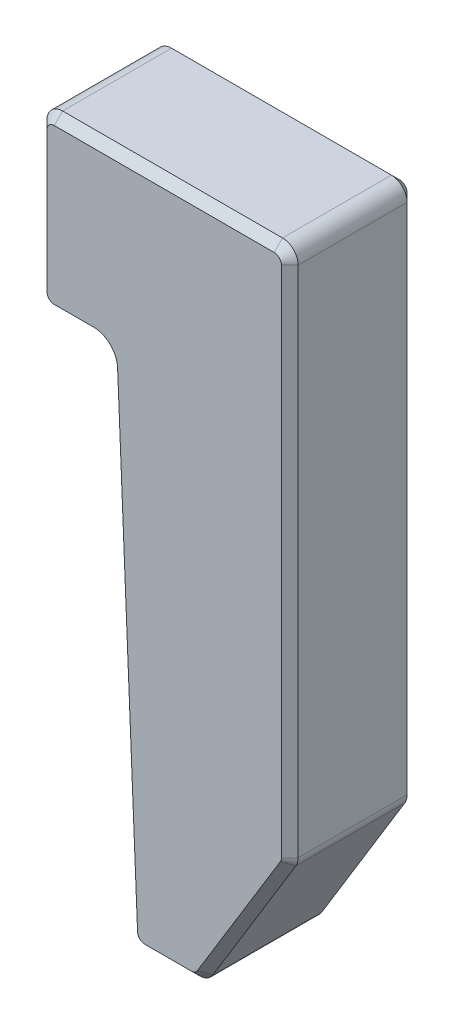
ISO-10303-21;
HEADER;
FILE_DESCRIPTION(('STEP AP214'),'2;1');
FILE_NAME('part.step','',(''),(''),'','','');
FILE_SCHEMA(('AUTOMOTIVE_DESIGN { 1 0 10303 214 1 1 1 1 }'));
ENDSEC;
DATA;
#1=APPLICATION_CONTEXT('core data for automotive mechanical design processes');
#2=APPLICATION_PROTOCOL_DEFINITION('international standard','automotive_design',2000,#1);
#3=PRODUCT_CONTEXT('',#1,'mechanical');
#4=PRODUCT('Part','Part','',(#3));
#5=PRODUCT_RELATED_PRODUCT_CATEGORY('part','',(#4));
#6=PRODUCT_DEFINITION_FORMATION('','',#4);
#7=PRODUCT_DEFINITION_CONTEXT('part definition',#1,'design');
#8=PRODUCT_DEFINITION('design','',#6,#7);
#9=PRODUCT_DEFINITION_SHAPE('','',#8);
#10=(LENGTH_UNIT() NAMED_UNIT(*) SI_UNIT(.MILLI.,.METRE.));
#11=(NAMED_UNIT(*) PLANE_ANGLE_UNIT() SI_UNIT($,.RADIAN.));
#12=(NAMED_UNIT(*) SI_UNIT($,.STERADIAN.) SOLID_ANGLE_UNIT());
#13=UNCERTAINTY_MEASURE_WITH_UNIT(LENGTH_MEASURE(1.E-05),#10,'distance_accuracy_value','');
#14=(GEOMETRIC_REPRESENTATION_CONTEXT(3) GLOBAL_UNCERTAINTY_ASSIGNED_CONTEXT((#13)) GLOBAL_UNIT_ASSIGNED_CONTEXT((#10,
#11,#12)) REPRESENTATION_CONTEXT('',''));
#15=CARTESIAN_POINT('',(0.,0.,0.));
#16=DIRECTION('',(0.,0.,1.));
#17=DIRECTION('',(1.,0.,0.));
#18=AXIS2_PLACEMENT_3D('',#15,#16,#17);
#19=CARTESIAN_POINT('',(3.445,3.61948185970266,3.));
#20=DIRECTION('',(0.,0.,-1.));
#21=DIRECTION('',(-1.,0.,0.));
#22=AXIS2_PLACEMENT_3D('',#19,#20,#21);
#23=CYLINDRICAL_SURFACE('',#22,0.375);
#24=DIRECTION('',(0.,0.,-1.));
#25=VECTOR('',#24,1.);
#26=CARTESIAN_POINT('',(3.76508154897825,3.42410324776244,3.));
#27=LINE('',#26,#25);
#28=CARTESIAN_POINT('',(3.76508154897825,3.42410324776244,2.8));
#29=VERTEX_POINT('',#28);
#30=CARTESIAN_POINT('',(3.76508154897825,3.42410324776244,0.200000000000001));
#31=VERTEX_POINT('',#30);
#32=EDGE_CURVE('E341',#29,#31,#27,.T.);
#33=ORIENTED_EDGE('',*,*,#32,.T.);
#34=CARTESIAN_POINT('',(3.445,3.61948185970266,0.200000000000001));
#35=DIRECTION('',(0.,0.,-1.));
#36=DIRECTION('',(-1.,0.,0.));
#37=AXIS2_PLACEMENT_3D('',#34,#35,#36);
#38=CIRCLE('',#37,0.375);
#39=CARTESIAN_POINT('',(3.82,3.61948185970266,0.200000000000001));
#40=VERTEX_POINT('',#39);
#41=EDGE_CURVE('E450',#31,#40,#38,.F.);
#42=ORIENTED_EDGE('',*,*,#41,.T.);
#43=DIRECTION('',(0.,0.,-1.));
#44=VECTOR('',#43,1.);
#45=CARTESIAN_POINT('',(3.82,3.61948185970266,3.));
#46=LINE('',#45,#44);
#47=CARTESIAN_POINT('',(3.82,3.61948185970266,2.8));
#48=VERTEX_POINT('',#47);
#49=EDGE_CURVE('E247',#48,#40,#46,.T.);
#50=ORIENTED_EDGE('',*,*,#49,.F.);
#51=CARTESIAN_POINT('',(3.445,3.61948185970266,2.8));
#52=DIRECTION('',(0.,0.,-1.));
#53=DIRECTION('',(-1.,0.,0.));
#54=AXIS2_PLACEMENT_3D('',#51,#52,#53);
#55=CIRCLE('',#54,0.375);
#56=EDGE_CURVE('E448',#48,#29,#55,.T.);
#57=ORIENTED_EDGE('',*,*,#56,.T.);
#58=EDGE_LOOP('',(#33,#42,#50,#57));
#59=FACE_BOUND('',#58,.T.);
#60=ADVANCED_FACE('F31',(#59),#23,.T.);
#61=CARTESIAN_POINT('',(3.82,15.875,3.));
#62=DIRECTION('',(-1.,0.,0.));
#63=DIRECTION('',(0.,-1.,0.));
#64=AXIS2_PLACEMENT_3D('',#61,#62,#63);
#65=PLANE('',#64);
#66=ORIENTED_EDGE('',*,*,#49,.T.);
#67=DIRECTION('',(0.,1.,0.));
#68=VECTOR('',#67,1.);
#69=CARTESIAN_POINT('',(3.82,15.875,0.200000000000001));
#70=LINE('',#69,#68);
#71=CARTESIAN_POINT('',(3.82,15.875,0.200000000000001));
#72=VERTEX_POINT('',#71);
#73=EDGE_CURVE('E458',#40,#72,#70,.T.);
#74=ORIENTED_EDGE('',*,*,#73,.T.);
#75=DIRECTION('',(0.,0.,-1.));
#76=VECTOR('',#75,1.);
#77=CARTESIAN_POINT('',(3.82,15.875,3.));
#78=LINE('',#77,#76);
#79=CARTESIAN_POINT('',(3.82,15.875,2.8));
#80=VERTEX_POINT('',#79);
#81=EDGE_CURVE('E377',#80,#72,#78,.T.);
#82=ORIENTED_EDGE('',*,*,#81,.F.);
#83=DIRECTION('',(0.,-1.,0.));
#84=VECTOR('',#83,1.);
#85=CARTESIAN_POINT('',(3.82,15.875,2.8));
#86=LINE('',#85,#84);
#87=EDGE_CURVE('E456',#80,#48,#86,.T.);
#88=ORIENTED_EDGE('',*,*,#87,.T.);
#89=EDGE_LOOP('',(#66,#74,#82,#88));
#90=FACE_BOUND('',#89,.T.);
#91=ADVANCED_FACE('F528',(#90),#65,.F.);
#92=CARTESIAN_POINT('',(3.445,15.875,3.));
#93=DIRECTION('',(0.,0.,-1.));
#94=DIRECTION('',(-1.,0.,0.));
#95=AXIS2_PLACEMENT_3D('',#92,#93,#94);
#96=CYLINDRICAL_SURFACE('',#95,0.375);
#97=ORIENTED_EDGE('',*,*,#81,.T.);
#98=CARTESIAN_POINT('',(3.445,15.875,0.200000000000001));
#99=DIRECTION('',(0.,0.,-1.));
#100=DIRECTION('',(-1.,0.,0.));
#101=AXIS2_PLACEMENT_3D('',#98,#99,#100);
#102=CIRCLE('',#101,0.375);
#103=CARTESIAN_POINT('',(3.44499999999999,16.25,0.200000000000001));
#104=VERTEX_POINT('',#103);
#105=EDGE_CURVE('E454',#72,#104,#102,.F.);
#106=ORIENTED_EDGE('',*,*,#105,.T.);
#107=DIRECTION('',(0.,0.,-1.));
#108=VECTOR('',#107,1.);
#109=CARTESIAN_POINT('',(3.44499999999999,16.25,3.));
#110=LINE('',#109,#108);
#111=CARTESIAN_POINT('',(3.44499999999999,16.25,2.8));
#112=VERTEX_POINT('',#111);
#113=EDGE_CURVE('E374',#112,#104,#110,.T.);
#114=ORIENTED_EDGE('',*,*,#113,.F.);
#115=CARTESIAN_POINT('',(3.445,15.875,2.8));
#116=DIRECTION('',(0.,0.,-1.));
#117=DIRECTION('',(-1.,0.,0.));
#118=AXIS2_PLACEMENT_3D('',#115,#116,#117);
#119=CIRCLE('',#118,0.375);
#120=EDGE_CURVE('E452',#112,#80,#119,.T.);
#121=ORIENTED_EDGE('',*,*,#120,.T.);
#122=EDGE_LOOP('',(#97,#106,#114,#121));
#123=FACE_BOUND('',#122,.T.);
#124=ADVANCED_FACE('F538',(#123),#96,.T.);
#125=CARTESIAN_POINT('',(-1.805,16.25,3.));
#126=DIRECTION('',(0.,-1.,0.));
#127=DIRECTION('',(0.,0.,-1.));
#128=AXIS2_PLACEMENT_3D('',#125,#126,#127);
#129=PLANE('',#128);
#130=ORIENTED_EDGE('',*,*,#113,.T.);
#131=DIRECTION('',(-1.,0.,0.));
#132=VECTOR('',#131,1.);
#133=CARTESIAN_POINT('',(-1.805,16.25,0.200000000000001));
#134=LINE('',#133,#132);
#135=CARTESIAN_POINT('',(-1.805,16.25,0.200000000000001));
#136=VERTEX_POINT('',#135);
#137=EDGE_CURVE('E446',#104,#136,#134,.T.);
#138=ORIENTED_EDGE('',*,*,#137,.T.);
#139=DIRECTION('',(0.,0.,-1.));
#140=VECTOR('',#139,1.);
#141=CARTESIAN_POINT('',(-1.805,16.25,3.));
#142=LINE('',#141,#140);
#143=CARTESIAN_POINT('',(-1.805,16.25,2.8));
#144=VERTEX_POINT('',#143);
#145=EDGE_CURVE('E371',#144,#136,#142,.T.);
#146=ORIENTED_EDGE('',*,*,#145,.F.);
#147=DIRECTION('',(1.,0.,0.));
#148=VECTOR('',#147,1.);
#149=CARTESIAN_POINT('',(-1.805,16.25,2.8));
#150=LINE('',#149,#148);
#151=EDGE_CURVE('E444',#144,#112,#150,.T.);
#152=ORIENTED_EDGE('',*,*,#151,.T.);
#153=EDGE_LOOP('',(#130,#138,#146,#152));
#154=FACE_BOUND('',#153,.T.);
#155=ADVANCED_FACE('F540',(#154),#129,.F.);
#156=CARTESIAN_POINT('',(-1.805,15.875,3.));
#157=DIRECTION('',(0.,0.,-1.));
#158=DIRECTION('',(-1.,0.,0.));
#159=AXIS2_PLACEMENT_3D('',#156,#157,#158);
#160=CYLINDRICAL_SURFACE('',#159,0.375);
#161=ORIENTED_EDGE('',*,*,#145,.T.);
#162=CARTESIAN_POINT('',(-1.805,15.875,0.200000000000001));
#163=DIRECTION('',(0.,0.,-1.));
#164=DIRECTION('',(-1.,0.,0.));
#165=AXIS2_PLACEMENT_3D('',#162,#163,#164);
#166=CIRCLE('',#165,0.375);
#167=CARTESIAN_POINT('',(-2.18,15.875,0.200000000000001));
#168=VERTEX_POINT('',#167);
#169=EDGE_CURVE('E438',#136,#168,#166,.F.);
#170=ORIENTED_EDGE('',*,*,#169,.T.);
#171=DIRECTION('',(0.,0.,-1.));
#172=VECTOR('',#171,1.);
#173=CARTESIAN_POINT('',(-2.18,15.875,3.));
#174=LINE('',#173,#172);
#175=CARTESIAN_POINT('',(-2.18,15.875,2.8));
#176=VERTEX_POINT('',#175);
#177=EDGE_CURVE('E368',#176,#168,#174,.T.);
#178=ORIENTED_EDGE('',*,*,#177,.F.);
#179=CARTESIAN_POINT('',(-1.805,15.875,2.8));
#180=DIRECTION('',(0.,0.,-1.));
#181=DIRECTION('',(-1.,0.,0.));
#182=AXIS2_PLACEMENT_3D('',#179,#180,#181);
#183=CIRCLE('',#182,0.375);
#184=EDGE_CURVE('E436',#176,#144,#183,.T.);
#185=ORIENTED_EDGE('',*,*,#184,.T.);
#186=EDGE_LOOP('',(#161,#170,#178,#185));
#187=FACE_BOUND('',#186,.T.);
#188=ADVANCED_FACE('F882',(#187),#160,.T.);
#189=CARTESIAN_POINT('',(-2.18,12.525,3.));
#190=DIRECTION('',(1.,0.,0.));
#191=DIRECTION('',(0.,0.,-1.));
#192=AXIS2_PLACEMENT_3D('',#189,#190,#191);
#193=PLANE('',#192);
#194=ORIENTED_EDGE('',*,*,#177,.T.);
#195=DIRECTION('',(0.,-1.,0.));
#196=VECTOR('',#195,1.);
#197=CARTESIAN_POINT('',(-2.18,12.525,0.200000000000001));
#198=LINE('',#197,#196);
#199=CARTESIAN_POINT('',(-2.18,12.525,0.200000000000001));
#200=VERTEX_POINT('',#199);
#201=EDGE_CURVE('E430',#168,#200,#198,.T.);
#202=ORIENTED_EDGE('',*,*,#201,.T.);
#203=DIRECTION('',(0.,0.,-1.));
#204=VECTOR('',#203,1.);
#205=CARTESIAN_POINT('',(-2.18,12.525,3.));
#206=LINE('',#205,#204);
#207=CARTESIAN_POINT('',(-2.18,12.525,2.8));
#208=VERTEX_POINT('',#207);
#209=EDGE_CURVE('E365',#208,#200,#206,.T.);
#210=ORIENTED_EDGE('',*,*,#209,.F.);
#211=DIRECTION('',(0.,1.,0.));
#212=VECTOR('',#211,1.);
#213=CARTESIAN_POINT('',(-2.18,12.525,2.8));
#214=LINE('',#213,#212);
#215=EDGE_CURVE('E428',#208,#176,#214,.T.);
#216=ORIENTED_EDGE('',*,*,#215,.T.);
#217=EDGE_LOOP('',(#194,#202,#210,#216));
#218=FACE_BOUND('',#217,.T.);
#219=ADVANCED_FACE('F873',(#218),#193,.F.);
#220=CARTESIAN_POINT('',(-1.805,12.525,3.));
#221=DIRECTION('',(0.,0.,-1.));
#222=DIRECTION('',(-1.,0.,0.));
#223=AXIS2_PLACEMENT_3D('',#220,#221,#222);
#224=CYLINDRICAL_SURFACE('',#223,0.375);
#225=ORIENTED_EDGE('',*,*,#209,.T.);
#226=CARTESIAN_POINT('',(-1.805,12.525,0.200000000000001));
#227=DIRECTION('',(0.,0.,-1.));
#228=DIRECTION('',(-1.,0.,0.));
#229=AXIS2_PLACEMENT_3D('',#226,#227,#228);
#230=CIRCLE('',#229,0.375);
#231=CARTESIAN_POINT('',(-1.805,12.15,0.200000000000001));
#232=VERTEX_POINT('',#231);
#233=EDGE_CURVE('E422',#200,#232,#230,.F.);
#234=ORIENTED_EDGE('',*,*,#233,.T.);
#235=DIRECTION('',(0.,0.,-1.));
#236=VECTOR('',#235,1.);
#237=CARTESIAN_POINT('',(-1.805,12.15,3.));
#238=LINE('',#237,#236);
#239=CARTESIAN_POINT('',(-1.805,12.15,2.8));
#240=VERTEX_POINT('',#239);
#241=EDGE_CURVE('E362',#240,#232,#238,.T.);
#242=ORIENTED_EDGE('',*,*,#241,.F.);
#243=CARTESIAN_POINT('',(-1.805,12.525,2.8));
#244=DIRECTION('',(0.,0.,-1.));
#245=DIRECTION('',(-1.,0.,0.));
#246=AXIS2_PLACEMENT_3D('',#243,#244,#245);
#247=CIRCLE('',#246,0.375);
#248=EDGE_CURVE('E420',#240,#208,#247,.T.);
#249=ORIENTED_EDGE('',*,*,#248,.T.);
#250=EDGE_LOOP('',(#225,#234,#242,#249));
#251=FACE_BOUND('',#250,.T.);
#252=ADVANCED_FACE('F864',(#251),#224,.T.);
#253=CARTESIAN_POINT('',(-0.866786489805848,12.15,3.));
#254=DIRECTION('',(0.,1.,0.));
#255=DIRECTION('',(0.,0.,1.));
#256=AXIS2_PLACEMENT_3D('',#253,#254,#255);
#257=PLANE('',#256);
#258=ORIENTED_EDGE('',*,*,#241,.T.);
#259=DIRECTION('',(1.,0.,0.));
#260=VECTOR('',#259,1.);
#261=CARTESIAN_POINT('',(-0.866786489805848,12.15,0.200000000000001));
#262=LINE('',#261,#260);
#263=CARTESIAN_POINT('',(-0.866786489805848,12.15,0.200000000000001));
#264=VERTEX_POINT('',#263);
#265=EDGE_CURVE('E414',#232,#264,#262,.T.);
#266=ORIENTED_EDGE('',*,*,#265,.T.);
#267=DIRECTION('',(0.,0.,-1.));
#268=VECTOR('',#267,1.);
#269=CARTESIAN_POINT('',(-0.866786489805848,12.15,3.));
#270=LINE('',#269,#268);
#271=CARTESIAN_POINT('',(-0.866786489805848,12.15,2.8));
#272=VERTEX_POINT('',#271);
#273=EDGE_CURVE('E242',#272,#264,#270,.T.);
#274=ORIENTED_EDGE('',*,*,#273,.F.);
#275=DIRECTION('',(-1.,0.,0.));
#276=VECTOR('',#275,1.);
#277=CARTESIAN_POINT('',(-0.866786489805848,12.15,2.8));
#278=LINE('',#277,#276);
#279=EDGE_CURVE('E412',#272,#240,#278,.T.);
#280=ORIENTED_EDGE('',*,*,#279,.T.);
#281=EDGE_LOOP('',(#258,#266,#274,#280));
#282=FACE_BOUND('',#281,.T.);
#283=ADVANCED_FACE('F856',(#282),#257,.F.);
#284=CARTESIAN_POINT('',(-0.866786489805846,11.775,3.));
#285=DIRECTION('',(0.,0.,-1.));
#286=DIRECTION('',(-1.,0.,0.));
#287=AXIS2_PLACEMENT_3D('',#284,#285,#286);
#288=CYLINDRICAL_SURFACE('',#287,0.375);
#289=ORIENTED_EDGE('',*,*,#273,.T.);
#290=CARTESIAN_POINT('',(-0.866786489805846,11.775,0.200000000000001));
#291=DIRECTION('',(0.,0.,-1.));
#292=DIRECTION('',(-1.,0.,0.));
#293=AXIS2_PLACEMENT_3D('',#290,#291,#292);
#294=CIRCLE('',#293,0.375);
#295=CARTESIAN_POINT('',(-0.492112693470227,11.7906379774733,0.200000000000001));
#296=VERTEX_POINT('',#295);
#297=EDGE_CURVE('E241',#264,#296,#294,.T.);
#298=ORIENTED_EDGE('',*,*,#297,.T.);
#299=DIRECTION('',(0.,0.,-1.));
#300=VECTOR('',#299,1.);
#301=CARTESIAN_POINT('',(-0.492112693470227,11.7906379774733,3.));
#302=LINE('',#301,#300);
#303=CARTESIAN_POINT('',(-0.492112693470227,11.7906379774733,2.8));
#304=VERTEX_POINT('',#303);
#305=EDGE_CURVE('E224',#304,#296,#302,.T.);
#306=ORIENTED_EDGE('',*,*,#305,.F.);
#307=CARTESIAN_POINT('',(-0.866786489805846,11.775,2.8));
#308=DIRECTION('',(0.,0.,-1.));
#309=DIRECTION('',(-1.,0.,0.));
#310=AXIS2_PLACEMENT_3D('',#307,#308,#309);
#311=CIRCLE('',#310,0.375);
#312=EDGE_CURVE('E238',#304,#272,#311,.F.);
#313=ORIENTED_EDGE('',*,*,#312,.T.);
#314=EDGE_LOOP('',(#289,#298,#306,#313));
#315=FACE_BOUND('',#314,.T.);
#316=ADVANCED_FACE('F237',(#315),#288,.F.);
#317=CARTESIAN_POINT('',(-0.0149989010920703,0.359362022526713,3.));
#318=DIRECTION('',(0.999130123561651,0.0417012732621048,0.));
#319=DIRECTION('',(-0.0417012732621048,0.999130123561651,0.));
#320=AXIS2_PLACEMENT_3D('',#317,#318,#319);
#321=PLANE('',#320);
#322=ORIENTED_EDGE('',*,*,#305,.T.);
#323=DIRECTION('',(0.0417012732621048,-0.999130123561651,0.));
#324=VECTOR('',#323,1.);
#325=CARTESIAN_POINT('',(-0.0149989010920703,0.359362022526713,0.200000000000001));
#326=LINE('',#325,#324);
#327=CARTESIAN_POINT('',(-0.0149989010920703,0.359362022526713,0.200000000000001));
#328=VERTEX_POINT('',#327);
#329=EDGE_CURVE('E230',#296,#328,#326,.T.);
#330=ORIENTED_EDGE('',*,*,#329,.T.);
#331=DIRECTION('',(0.,0.,-1.));
#332=VECTOR('',#331,1.);
#333=CARTESIAN_POINT('',(-0.0149989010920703,0.359362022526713,3.));
#334=LINE('',#333,#332);
#335=CARTESIAN_POINT('',(-0.0149989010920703,0.359362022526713,2.8));
#336=VERTEX_POINT('',#335);
#337=EDGE_CURVE('E226',#336,#328,#334,.T.);
#338=ORIENTED_EDGE('',*,*,#337,.F.);
#339=DIRECTION('',(-0.0417012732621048,0.999130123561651,0.));
#340=VECTOR('',#339,1.);
#341=CARTESIAN_POINT('',(-0.0149989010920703,0.359362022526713,2.8));
#342=LINE('',#341,#340);
#343=EDGE_CURVE('E221',#336,#304,#342,.T.);
#344=ORIENTED_EDGE('',*,*,#343,.T.);
#345=EDGE_LOOP('',(#322,#330,#338,#344));
#346=FACE_BOUND('',#345,.T.);
#347=ADVANCED_FACE('F223',(#346),#321,.F.);
#348=CARTESIAN_POINT('',(0.359674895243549,0.375,3.));
#349=DIRECTION('',(0.,0.,-1.));
#350=DIRECTION('',(-1.,0.,0.));
#351=AXIS2_PLACEMENT_3D('',#348,#349,#350);
#352=CYLINDRICAL_SURFACE('',#351,0.375);
#353=ORIENTED_EDGE('',*,*,#337,.T.);
#354=CARTESIAN_POINT('',(0.359674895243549,0.375,0.200000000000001));
#355=DIRECTION('',(0.,0.,-1.));
#356=DIRECTION('',(-1.,0.,0.));
#357=AXIS2_PLACEMENT_3D('',#354,#355,#356);
#358=CIRCLE('',#357,0.375);
#359=CARTESIAN_POINT('',(0.359674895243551,0.,0.200000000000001));
#360=VERTEX_POINT('',#359);
#361=EDGE_CURVE('E418',#328,#360,#358,.F.);
#362=ORIENTED_EDGE('',*,*,#361,.T.);
#363=DIRECTION('',(0.,0.,-1.));
#364=VECTOR('',#363,1.);
#365=CARTESIAN_POINT('',(0.359674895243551,0.,3.));
#366=LINE('',#365,#364);
#367=CARTESIAN_POINT('',(0.359674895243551,0.,2.8));
#368=VERTEX_POINT('',#367);
#369=EDGE_CURVE('E357',#368,#360,#366,.T.);
#370=ORIENTED_EDGE('',*,*,#369,.F.);
#371=CARTESIAN_POINT('',(0.359674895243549,0.375,2.8));
#372=DIRECTION('',(0.,0.,-1.));
#373=DIRECTION('',(-1.,0.,0.));
#374=AXIS2_PLACEMENT_3D('',#371,#372,#373);
#375=CIRCLE('',#374,0.375);
#376=EDGE_CURVE('E416',#368,#336,#375,.T.);
#377=ORIENTED_EDGE('',*,*,#376,.T.);
#378=EDGE_LOOP('',(#353,#362,#370,#377));
#379=FACE_BOUND('',#378,.T.);
#380=ADVANCED_FACE('F832',(#379),#352,.T.);
#381=CARTESIAN_POINT('',(1.46455981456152,0.,3.));
#382=DIRECTION('',(0.,1.,0.));
#383=DIRECTION('',(-1.,0.,0.));
#384=AXIS2_PLACEMENT_3D('',#381,#382,#383);
#385=PLANE('',#384);
#386=ORIENTED_EDGE('',*,*,#369,.T.);
#387=DIRECTION('',(1.,0.,0.));
#388=VECTOR('',#387,1.);
#389=CARTESIAN_POINT('',(1.46455981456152,0.,0.200000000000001));
#390=LINE('',#389,#388);
#391=CARTESIAN_POINT('',(1.46455981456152,0.,0.200000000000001));
#392=VERTEX_POINT('',#391);
#393=EDGE_CURVE('E426',#360,#392,#390,.T.);
#394=ORIENTED_EDGE('',*,*,#393,.T.);
#395=DIRECTION('',(0.,0.,-1.));
#396=VECTOR('',#395,1.);
#397=CARTESIAN_POINT('',(1.46455981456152,0.,3.));
#398=LINE('',#397,#396);
#399=CARTESIAN_POINT('',(1.46455981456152,0.,2.8));
#400=VERTEX_POINT('',#399);
#401=EDGE_CURVE('E352',#400,#392,#398,.T.);
#402=ORIENTED_EDGE('',*,*,#401,.F.);
#403=DIRECTION('',(-1.,0.,0.));
#404=VECTOR('',#403,1.);
#405=CARTESIAN_POINT('',(1.46455981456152,0.,2.8));
#406=LINE('',#405,#404);
#407=EDGE_CURVE('E424',#400,#368,#406,.T.);
#408=ORIENTED_EDGE('',*,*,#407,.T.);
#409=EDGE_LOOP('',(#386,#394,#402,#408));
#410=FACE_BOUND('',#409,.T.);
#411=ADVANCED_FACE('F823',(#410),#385,.F.);
#412=CARTESIAN_POINT('',(1.46455981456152,0.375,3.));
#413=DIRECTION('',(0.,0.,-1.));
#414=DIRECTION('',(-1.,0.,0.));
#415=AXIS2_PLACEMENT_3D('',#412,#413,#414);
#416=CYLINDRICAL_SURFACE('',#415,0.375);
#417=ORIENTED_EDGE('',*,*,#401,.T.);
#418=CARTESIAN_POINT('',(1.46455981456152,0.375,0.200000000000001));
#419=DIRECTION('',(0.,0.,-1.));
#420=DIRECTION('',(-1.,0.,0.));
#421=AXIS2_PLACEMENT_3D('',#418,#419,#420);
#422=CIRCLE('',#421,0.375);
#423=CARTESIAN_POINT('',(1.78464136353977,0.179621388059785,0.200000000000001));
#424=VERTEX_POINT('',#423);
#425=EDGE_CURVE('E434',#392,#424,#422,.F.);
#426=ORIENTED_EDGE('',*,*,#425,.T.);
#427=DIRECTION('',(0.,0.,-1.));
#428=VECTOR('',#427,1.);
#429=CARTESIAN_POINT('',(1.78464136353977,0.179621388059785,3.));
#430=LINE('',#429,#428);
#431=CARTESIAN_POINT('',(1.78464136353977,0.179621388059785,2.8));
#432=VERTEX_POINT('',#431);
#433=EDGE_CURVE('E347',#432,#424,#430,.T.);
#434=ORIENTED_EDGE('',*,*,#433,.F.);
#435=CARTESIAN_POINT('',(1.46455981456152,0.375,2.8));
#436=DIRECTION('',(0.,0.,-1.));
#437=DIRECTION('',(-1.,0.,0.));
#438=AXIS2_PLACEMENT_3D('',#435,#436,#437);
#439=CIRCLE('',#438,0.375);
#440=EDGE_CURVE('E432',#432,#400,#439,.T.);
#441=ORIENTED_EDGE('',*,*,#440,.T.);
#442=EDGE_LOOP('',(#417,#426,#434,#441));
#443=FACE_BOUND('',#442,.T.);
#444=ADVANCED_FACE('F815',(#443),#416,.T.);
#445=CARTESIAN_POINT('',(3.76508154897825,3.42410324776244,3.));
#446=DIRECTION('',(-0.853550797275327,0.521009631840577,0.));
#447=DIRECTION('',(-0.521009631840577,-0.853550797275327,0.));
#448=AXIS2_PLACEMENT_3D('',#445,#446,#447);
#449=PLANE('',#448);
#450=ORIENTED_EDGE('',*,*,#433,.T.);
#451=DIRECTION('',(0.521009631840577,0.853550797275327,0.));
#452=VECTOR('',#451,1.);
#453=CARTESIAN_POINT('',(3.76508154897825,3.42410324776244,0.200000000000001));
#454=LINE('',#453,#452);
#455=EDGE_CURVE('E442',#424,#31,#454,.T.);
#456=ORIENTED_EDGE('',*,*,#455,.T.);
#457=ORIENTED_EDGE('',*,*,#32,.F.);
#458=DIRECTION('',(-0.521009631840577,-0.853550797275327,0.));
#459=VECTOR('',#458,1.);
#460=CARTESIAN_POINT('',(3.76508154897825,3.42410324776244,2.8));
#461=LINE('',#460,#459);
#462=EDGE_CURVE('E440',#29,#432,#461,.T.);
#463=ORIENTED_EDGE('',*,*,#462,.T.);
#464=EDGE_LOOP('',(#450,#456,#457,#463));
#465=FACE_BOUND('',#464,.T.);
#466=ADVANCED_FACE('F507',(#465),#449,.F.);
#467=CARTESIAN_POINT('',(3.445,3.61948185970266,3.));
#468=DIRECTION('',(0.,0.,-1.));
#469=DIRECTION('',(-1.,0.,0.));
#470=AXIS2_PLACEMENT_3D('',#467,#468,#469);
#471=PLANE('',#470);
#472=DIRECTION('',(1.,0.,0.));
#473=VECTOR('',#472,1.);
#474=CARTESIAN_POINT('',(3.445,12.35,3.));
#475=LINE('',#474,#473);
#476=CARTESIAN_POINT('',(-1.805,12.35,3.));
#477=VERTEX_POINT('',#476);
#478=CARTESIAN_POINT('',(-0.86678648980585,12.35,3.));
#479=VERTEX_POINT('',#478);
#480=EDGE_CURVE('E55',#477,#479,#475,.T.);
#481=ORIENTED_EDGE('',*,*,#480,.T.);
#482=CARTESIAN_POINT('',(-0.866786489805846,11.775,3.));
#483=DIRECTION('',(0.,0.,-1.));
#484=DIRECTION('',(-1.,0.,0.));
#485=AXIS2_PLACEMENT_3D('',#482,#483,#484);
#486=CIRCLE('',#485,0.574999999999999);
#487=CARTESIAN_POINT('',(-0.292286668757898,11.7989782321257,3.));
#488=VERTEX_POINT('',#487);
#489=EDGE_CURVE('E11',#479,#488,#486,.T.);
#490=ORIENTED_EDGE('',*,*,#489,.T.);
#491=DIRECTION('',(0.0417012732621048,-0.999130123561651,0.));
#492=VECTOR('',#491,1.);
#493=CARTESIAN_POINT('',(0.0550111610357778,3.47799193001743,3.));
#494=LINE('',#493,#492);
#495=CARTESIAN_POINT('',(0.184827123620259,0.367702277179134,3.));
#496=VERTEX_POINT('',#495);
#497=EDGE_CURVE('E40',#488,#496,#494,.T.);
#498=ORIENTED_EDGE('',*,*,#497,.T.);
#499=CARTESIAN_POINT('',(0.359674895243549,0.375,3.));
#500=DIRECTION('',(0.,0.,-1.));
#501=DIRECTION('',(-1.,0.,0.));
#502=AXIS2_PLACEMENT_3D('',#499,#500,#501);
#503=CIRCLE('',#502,0.175000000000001);
#504=CARTESIAN_POINT('',(0.35967489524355,0.199999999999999,3.));
#505=VERTEX_POINT('',#504);
#506=EDGE_CURVE('E480',#496,#505,#503,.F.);
#507=ORIENTED_EDGE('',*,*,#506,.T.);
#508=DIRECTION('',(1.,0.,0.));
#509=VECTOR('',#508,1.);
#510=CARTESIAN_POINT('',(3.445,0.199999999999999,3.));
#511=LINE('',#510,#509);
#512=CARTESIAN_POINT('',(1.46455981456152,0.199999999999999,3.));
#513=VERTEX_POINT('',#512);
#514=EDGE_CURVE('E476',#505,#513,#511,.T.);
#515=ORIENTED_EDGE('',*,*,#514,.T.);
#516=CARTESIAN_POINT('',(1.46455981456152,0.375,3.));
#517=DIRECTION('',(0.,0.,-1.));
#518=DIRECTION('',(-1.,0.,0.));
#519=AXIS2_PLACEMENT_3D('',#516,#517,#518);
#520=CIRCLE('',#519,0.175000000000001);
#521=CARTESIAN_POINT('',(1.6139312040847,0.283823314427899,3.));
#522=VERTEX_POINT('',#521);
#523=EDGE_CURVE('E472',#513,#522,#520,.F.);
#524=ORIENTED_EDGE('',*,*,#523,.T.);
#525=DIRECTION('',(0.521009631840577,0.853550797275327,0.));
#526=VECTOR('',#525,1.);
#527=CARTESIAN_POINT('',(3.59437138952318,3.52830517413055,3.));
#528=LINE('',#527,#526);
#529=CARTESIAN_POINT('',(3.59437138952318,3.52830517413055,3.));
#530=VERTEX_POINT('',#529);
#531=EDGE_CURVE('E468',#522,#530,#528,.T.);
#532=ORIENTED_EDGE('',*,*,#531,.T.);
#533=CARTESIAN_POINT('',(3.445,3.61948185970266,3.));
#534=DIRECTION('',(0.,0.,-1.));
#535=DIRECTION('',(-1.,0.,0.));
#536=AXIS2_PLACEMENT_3D('',#533,#534,#535);
#537=CIRCLE('',#536,0.175000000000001);
#538=CARTESIAN_POINT('',(3.62,3.61948185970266,3.));
#539=VERTEX_POINT('',#538);
#540=EDGE_CURVE('E464',#530,#539,#537,.F.);
#541=ORIENTED_EDGE('',*,*,#540,.T.);
#542=DIRECTION('',(0.,1.,0.));
#543=VECTOR('',#542,1.);
#544=CARTESIAN_POINT('',(3.62,3.61948185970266,3.));
#545=LINE('',#544,#543);
#546=CARTESIAN_POINT('',(3.62,15.875,3.));
#547=VERTEX_POINT('',#546);
#548=EDGE_CURVE('E460',#539,#547,#545,.T.);
#549=ORIENTED_EDGE('',*,*,#548,.T.);
#550=CARTESIAN_POINT('',(3.445,15.875,3.));
#551=DIRECTION('',(0.,0.,-1.));
#552=DIRECTION('',(-1.,0.,0.));
#553=AXIS2_PLACEMENT_3D('',#550,#551,#552);
#554=CIRCLE('',#553,0.175000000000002);
#555=CARTESIAN_POINT('',(3.44499999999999,16.05,3.));
#556=VERTEX_POINT('',#555);
#557=EDGE_CURVE('E462',#547,#556,#554,.F.);
#558=ORIENTED_EDGE('',*,*,#557,.T.);
#559=DIRECTION('',(-1.,0.,0.));
#560=VECTOR('',#559,1.);
#561=CARTESIAN_POINT('',(3.445,16.05,3.));
#562=LINE('',#561,#560);
#563=CARTESIAN_POINT('',(-1.805,16.05,3.));
#564=VERTEX_POINT('',#563);
#565=EDGE_CURVE('E466',#556,#564,#562,.T.);
#566=ORIENTED_EDGE('',*,*,#565,.T.);
#567=CARTESIAN_POINT('',(-1.805,15.875,3.));
#568=DIRECTION('',(0.,0.,-1.));
#569=DIRECTION('',(-1.,0.,0.));
#570=AXIS2_PLACEMENT_3D('',#567,#568,#569);
#571=CIRCLE('',#570,0.175000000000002);
#572=CARTESIAN_POINT('',(-1.98,15.875,3.));
#573=VERTEX_POINT('',#572);
#574=EDGE_CURVE('E470',#564,#573,#571,.F.);
#575=ORIENTED_EDGE('',*,*,#574,.T.);
#576=DIRECTION('',(0.,-1.,0.));
#577=VECTOR('',#576,1.);
#578=CARTESIAN_POINT('',(-1.98,3.61948185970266,3.));
#579=LINE('',#578,#577);
#580=CARTESIAN_POINT('',(-1.98,12.525,3.));
#581=VERTEX_POINT('',#580);
#582=EDGE_CURVE('E474',#573,#581,#579,.T.);
#583=ORIENTED_EDGE('',*,*,#582,.T.);
#584=CARTESIAN_POINT('',(-1.805,12.525,3.));
#585=DIRECTION('',(0.,0.,-1.));
#586=DIRECTION('',(-1.,0.,0.));
#587=AXIS2_PLACEMENT_3D('',#584,#585,#586);
#588=CIRCLE('',#587,0.175000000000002);
#589=EDGE_CURVE('E478',#581,#477,#588,.F.);
#590=ORIENTED_EDGE('',*,*,#589,.T.);
#591=EDGE_LOOP('',(#481,#490,#498,#507,#515,#524,#532,#541,#549,#558,#566,#575,#583,#590));
#592=FACE_BOUND('',#591,.T.);
#593=ADVANCED_FACE('F483',(#592),#471,.F.);
#594=CARTESIAN_POINT('',(3.445,3.61948185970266,0.));
#595=DIRECTION('',(0.,0.,-1.));
#596=DIRECTION('',(-1.,0.,0.));
#597=AXIS2_PLACEMENT_3D('',#594,#595,#596);
#598=PLANE('',#597);
#599=DIRECTION('',(-0.0417012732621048,0.999130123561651,0.));
#600=VECTOR('',#599,1.);
#601=CARTESIAN_POINT('',(-0.292286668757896,11.7989782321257,0.));
#602=LINE('',#601,#600);
#603=CARTESIAN_POINT('',(0.18482712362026,0.367702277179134,0.));
#604=VERTEX_POINT('',#603);
#605=CARTESIAN_POINT('',(-0.292286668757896,11.7989782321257,0.));
#606=VERTEX_POINT('',#605);
#607=EDGE_CURVE('E407',#604,#606,#602,.T.);
#608=ORIENTED_EDGE('',*,*,#607,.T.);
#609=CARTESIAN_POINT('',(-0.866786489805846,11.775,0.));
#610=DIRECTION('',(0.,0.,-1.));
#611=DIRECTION('',(-1.,0.,0.));
#612=AXIS2_PLACEMENT_3D('',#609,#610,#611);
#613=CIRCLE('',#612,0.575000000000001);
#614=CARTESIAN_POINT('',(-0.86678648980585,12.35,0.));
#615=VERTEX_POINT('',#614);
#616=EDGE_CURVE('E231',#606,#615,#613,.F.);
#617=ORIENTED_EDGE('',*,*,#616,.T.);
#618=DIRECTION('',(-1.,0.,0.));
#619=VECTOR('',#618,1.);
#620=CARTESIAN_POINT('',(-1.805,12.35,0.));
#621=LINE('',#620,#619);
#622=CARTESIAN_POINT('',(-1.805,12.35,0.));
#623=VERTEX_POINT('',#622);
#624=EDGE_CURVE('E405',#615,#623,#621,.T.);
#625=ORIENTED_EDGE('',*,*,#624,.T.);
#626=CARTESIAN_POINT('',(-1.805,12.525,0.));
#627=DIRECTION('',(0.,0.,-1.));
#628=DIRECTION('',(-1.,0.,0.));
#629=AXIS2_PLACEMENT_3D('',#626,#627,#628);
#630=CIRCLE('',#629,0.175);
#631=CARTESIAN_POINT('',(-1.98,12.525,0.));
#632=VERTEX_POINT('',#631);
#633=EDGE_CURVE('E401',#623,#632,#630,.T.);
#634=ORIENTED_EDGE('',*,*,#633,.T.);
#635=DIRECTION('',(0.,1.,0.));
#636=VECTOR('',#635,1.);
#637=CARTESIAN_POINT('',(-1.98,15.875,0.));
#638=LINE('',#637,#636);
#639=CARTESIAN_POINT('',(-1.98,15.875,0.));
#640=VERTEX_POINT('',#639);
#641=EDGE_CURVE('E397',#632,#640,#638,.T.);
#642=ORIENTED_EDGE('',*,*,#641,.T.);
#643=CARTESIAN_POINT('',(-1.805,15.875,0.));
#644=DIRECTION('',(0.,0.,-1.));
#645=DIRECTION('',(-1.,0.,0.));
#646=AXIS2_PLACEMENT_3D('',#643,#644,#645);
#647=CIRCLE('',#646,0.174999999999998);
#648=CARTESIAN_POINT('',(-1.805,16.05,0.));
#649=VERTEX_POINT('',#648);
#650=EDGE_CURVE('E393',#640,#649,#647,.T.);
#651=ORIENTED_EDGE('',*,*,#650,.T.);
#652=DIRECTION('',(1.,0.,0.));
#653=VECTOR('',#652,1.);
#654=CARTESIAN_POINT('',(3.44499999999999,16.05,0.));
#655=LINE('',#654,#653);
#656=CARTESIAN_POINT('',(3.44499999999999,16.05,0.));
#657=VERTEX_POINT('',#656);
#658=EDGE_CURVE('E389',#649,#657,#655,.T.);
#659=ORIENTED_EDGE('',*,*,#658,.T.);
#660=CARTESIAN_POINT('',(3.445,15.875,0.));
#661=DIRECTION('',(0.,0.,-1.));
#662=DIRECTION('',(-1.,0.,0.));
#663=AXIS2_PLACEMENT_3D('',#660,#661,#662);
#664=CIRCLE('',#663,0.174999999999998);
#665=CARTESIAN_POINT('',(3.62,15.875,0.));
#666=VERTEX_POINT('',#665);
#667=EDGE_CURVE('E385',#657,#666,#664,.T.);
#668=ORIENTED_EDGE('',*,*,#667,.T.);
#669=DIRECTION('',(0.,-1.,0.));
#670=VECTOR('',#669,1.);
#671=CARTESIAN_POINT('',(3.62,3.61948185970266,0.));
#672=LINE('',#671,#670);
#673=CARTESIAN_POINT('',(3.62,3.61948185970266,0.));
#674=VERTEX_POINT('',#673);
#675=EDGE_CURVE('E383',#666,#674,#672,.T.);
#676=ORIENTED_EDGE('',*,*,#675,.T.);
#677=CARTESIAN_POINT('',(3.445,3.61948185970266,0.));
#678=DIRECTION('',(0.,0.,-1.));
#679=DIRECTION('',(-1.,0.,0.));
#680=AXIS2_PLACEMENT_3D('',#677,#678,#679);
#681=CIRCLE('',#680,0.174999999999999);
#682=CARTESIAN_POINT('',(3.59437138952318,3.52830517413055,0.));
#683=VERTEX_POINT('',#682);
#684=EDGE_CURVE('E387',#674,#683,#681,.T.);
#685=ORIENTED_EDGE('',*,*,#684,.T.);
#686=DIRECTION('',(-0.521009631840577,-0.853550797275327,0.));
#687=VECTOR('',#686,1.);
#688=CARTESIAN_POINT('',(1.6139312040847,0.283823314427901,0.));
#689=LINE('',#688,#687);
#690=CARTESIAN_POINT('',(1.6139312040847,0.2838233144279,0.));
#691=VERTEX_POINT('',#690);
#692=EDGE_CURVE('E391',#683,#691,#689,.T.);
#693=ORIENTED_EDGE('',*,*,#692,.T.);
#694=CARTESIAN_POINT('',(1.46455981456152,0.375,0.));
#695=DIRECTION('',(0.,0.,-1.));
#696=DIRECTION('',(-1.,0.,0.));
#697=AXIS2_PLACEMENT_3D('',#694,#695,#696);
#698=CIRCLE('',#697,0.175);
#699=CARTESIAN_POINT('',(1.46455981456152,0.200000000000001,0.));
#700=VERTEX_POINT('',#699);
#701=EDGE_CURVE('E395',#691,#700,#698,.T.);
#702=ORIENTED_EDGE('',*,*,#701,.T.);
#703=DIRECTION('',(-1.,0.,0.));
#704=VECTOR('',#703,1.);
#705=CARTESIAN_POINT('',(0.359674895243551,0.200000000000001,0.));
#706=LINE('',#705,#704);
#707=CARTESIAN_POINT('',(0.35967489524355,0.200000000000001,0.));
#708=VERTEX_POINT('',#707);
#709=EDGE_CURVE('E399',#700,#708,#706,.T.);
#710=ORIENTED_EDGE('',*,*,#709,.T.);
#711=CARTESIAN_POINT('',(0.359674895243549,0.375,0.));
#712=DIRECTION('',(0.,0.,-1.));
#713=DIRECTION('',(-1.,0.,0.));
#714=AXIS2_PLACEMENT_3D('',#711,#712,#713);
#715=CIRCLE('',#714,0.175);
#716=EDGE_CURVE('E403',#708,#604,#715,.T.);
#717=ORIENTED_EDGE('',*,*,#716,.T.);
#718=EDGE_LOOP('',(#608,#617,#625,#634,#642,#651,#659,#668,#676,#685,#693,#702,#710,#717));
#719=FACE_BOUND('',#718,.T.);
#720=ADVANCED_FACE('F522',(#719),#598,.T.);
#721=CARTESIAN_POINT('',(3.82,15.875,0.200000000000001));
#722=DIRECTION('',(0.707106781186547,0.,-0.707106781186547));
#723=DIRECTION('',(-0.707106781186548,0.,-0.707106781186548));
#724=AXIS2_PLACEMENT_3D('',#721,#722,#723);
#725=PLANE('',#724);
#726=DIRECTION('',(0.707106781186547,0.,0.707106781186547));
#727=VECTOR('',#726,1.);
#728=CARTESIAN_POINT('',(3.62,3.61948185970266,0.));
#729=LINE('',#728,#727);
#730=EDGE_CURVE('E334',#674,#40,#729,.T.);
#731=ORIENTED_EDGE('',*,*,#730,.F.);
#732=ORIENTED_EDGE('',*,*,#675,.F.);
#733=DIRECTION('',(-0.707106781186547,0.,-0.707106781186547));
#734=VECTOR('',#733,1.);
#735=CARTESIAN_POINT('',(3.82,15.875,0.200000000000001));
#736=LINE('',#735,#734);
#737=EDGE_CURVE('E254',#72,#666,#736,.T.);
#738=ORIENTED_EDGE('',*,*,#737,.F.);
#739=ORIENTED_EDGE('',*,*,#73,.F.);
#740=EDGE_LOOP('',(#731,#732,#738,#739));
#741=FACE_BOUND('',#740,.T.);
#742=ADVANCED_FACE('F532',(#741),#725,.T.);
#743=CARTESIAN_POINT('',(3.445,15.875,0.200000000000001));
#744=DIRECTION('',(0.,0.,1.));
#745=DIRECTION('',(1.,0.,0.));
#746=AXIS2_PLACEMENT_3D('',#743,#744,#745);
#747=CONICAL_SURFACE('',#746,0.375,0.785398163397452);
#748=ORIENTED_EDGE('',*,*,#737,.T.);
#749=ORIENTED_EDGE('',*,*,#667,.F.);
#750=DIRECTION('',(0.,-0.707106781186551,-0.707106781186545));
#751=VECTOR('',#750,1.);
#752=CARTESIAN_POINT('',(3.44499999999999,16.25,0.200000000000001));
#753=LINE('',#752,#751);
#754=EDGE_CURVE('E332',#104,#657,#753,.T.);
#755=ORIENTED_EDGE('',*,*,#754,.F.);
#756=ORIENTED_EDGE('',*,*,#105,.F.);
#757=EDGE_LOOP('',(#748,#749,#755,#756));
#758=FACE_BOUND('',#757,.T.);
#759=ADVANCED_FACE('F534',(#758),#747,.T.);
#760=CARTESIAN_POINT('',(3.445,3.61948185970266,0.200000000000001));
#761=DIRECTION('',(0.,0.,1.));
#762=DIRECTION('',(1.,0.,0.));
#763=AXIS2_PLACEMENT_3D('',#760,#761,#762);
#764=CONICAL_SURFACE('',#763,0.375,0.785398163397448);
#765=ORIENTED_EDGE('',*,*,#730,.T.);
#766=ORIENTED_EDGE('',*,*,#41,.F.);
#767=DIRECTION('',(0.603551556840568,-0.368409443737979,0.707106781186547));
#768=VECTOR('',#767,1.);
#769=CARTESIAN_POINT('',(3.59437138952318,3.52830517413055,0.));
#770=LINE('',#769,#768);
#771=EDGE_CURVE('E329',#683,#31,#770,.T.);
#772=ORIENTED_EDGE('',*,*,#771,.F.);
#773=ORIENTED_EDGE('',*,*,#684,.F.);
#774=EDGE_LOOP('',(#765,#766,#772,#773));
#775=FACE_BOUND('',#774,.T.);
#776=ADVANCED_FACE('F525',(#775),#764,.T.);
#777=CARTESIAN_POINT('',(-1.805,16.25,0.200000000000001));
#778=DIRECTION('',(0.,0.707106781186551,-0.707106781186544));
#779=DIRECTION('',(0.,0.707106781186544,0.707106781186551));
#780=AXIS2_PLACEMENT_3D('',#777,#778,#779);
#781=PLANE('',#780);
#782=ORIENTED_EDGE('',*,*,#754,.T.);
#783=ORIENTED_EDGE('',*,*,#658,.F.);
#784=DIRECTION('',(0.,-0.707106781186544,-0.707106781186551));
#785=VECTOR('',#784,1.);
#786=CARTESIAN_POINT('',(-1.805,16.25,0.200000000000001));
#787=LINE('',#786,#785);
#788=EDGE_CURVE('E326',#136,#649,#787,.T.);
#789=ORIENTED_EDGE('',*,*,#788,.F.);
#790=ORIENTED_EDGE('',*,*,#137,.F.);
#791=EDGE_LOOP('',(#782,#783,#789,#790));
#792=FACE_BOUND('',#791,.T.);
#793=ADVANCED_FACE('F604',(#792),#781,.T.);
#794=CARTESIAN_POINT('',(3.76508154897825,3.42410324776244,0.200000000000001));
#795=DIRECTION('',(0.603551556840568,-0.368409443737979,-0.707106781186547));
#796=DIRECTION('',(-0.760604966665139,0.,-0.649214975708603));
#797=AXIS2_PLACEMENT_3D('',#794,#795,#796);
#798=PLANE('',#797);
#799=ORIENTED_EDGE('',*,*,#771,.T.);
#800=ORIENTED_EDGE('',*,*,#455,.F.);
#801=DIRECTION('',(0.60355155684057,-0.368409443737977,0.707106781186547));
#802=VECTOR('',#801,1.);
#803=CARTESIAN_POINT('',(1.6139312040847,0.2838233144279,0.));
#804=LINE('',#803,#802);
#805=EDGE_CURVE('E323',#691,#424,#804,.T.);
#806=ORIENTED_EDGE('',*,*,#805,.F.);
#807=ORIENTED_EDGE('',*,*,#692,.F.);
#808=EDGE_LOOP('',(#799,#800,#806,#807));
#809=FACE_BOUND('',#808,.T.);
#810=ADVANCED_FACE('F512',(#809),#798,.T.);
#811=CARTESIAN_POINT('',(-1.805,15.875,0.200000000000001));
#812=DIRECTION('',(0.,0.,1.));
#813=DIRECTION('',(1.,0.,0.));
#814=AXIS2_PLACEMENT_3D('',#811,#812,#813);
#815=CONICAL_SURFACE('',#814,0.375,0.785398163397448);
#816=ORIENTED_EDGE('',*,*,#788,.T.);
#817=ORIENTED_EDGE('',*,*,#650,.F.);
#818=DIRECTION('',(0.70710678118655,0.,-0.707106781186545));
#819=VECTOR('',#818,1.);
#820=CARTESIAN_POINT('',(-2.18,15.875,0.200000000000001));
#821=LINE('',#820,#819);
#822=EDGE_CURVE('E320',#168,#640,#821,.T.);
#823=ORIENTED_EDGE('',*,*,#822,.F.);
#824=ORIENTED_EDGE('',*,*,#169,.F.);
#825=EDGE_LOOP('',(#816,#817,#823,#824));
#826=FACE_BOUND('',#825,.T.);
#827=ADVANCED_FACE('F598',(#826),#815,.T.);
#828=CARTESIAN_POINT('',(1.46455981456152,0.375,0.200000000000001));
#829=DIRECTION('',(0.,0.,1.));
#830=DIRECTION('',(1.,0.,0.));
#831=AXIS2_PLACEMENT_3D('',#828,#829,#830);
#832=CONICAL_SURFACE('',#831,0.375,0.785398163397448);
#833=ORIENTED_EDGE('',*,*,#805,.T.);
#834=ORIENTED_EDGE('',*,*,#425,.F.);
#835=DIRECTION('',(0.,-0.707106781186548,0.707106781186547));
#836=VECTOR('',#835,1.);
#837=CARTESIAN_POINT('',(1.46455981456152,0.200000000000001,0.));
#838=LINE('',#837,#836);
#839=EDGE_CURVE('E317',#700,#392,#838,.T.);
#840=ORIENTED_EDGE('',*,*,#839,.F.);
#841=ORIENTED_EDGE('',*,*,#701,.F.);
#842=EDGE_LOOP('',(#833,#834,#840,#841));
#843=FACE_BOUND('',#842,.T.);
#844=ADVANCED_FACE('F518',(#843),#832,.T.);
#845=CARTESIAN_POINT('',(-2.18,12.525,0.200000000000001));
#846=DIRECTION('',(-0.707106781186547,0.,-0.707106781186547));
#847=DIRECTION('',(-0.707106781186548,0.,0.707106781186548));
#848=AXIS2_PLACEMENT_3D('',#845,#846,#847);
#849=PLANE('',#848);
#850=ORIENTED_EDGE('',*,*,#822,.T.);
#851=ORIENTED_EDGE('',*,*,#641,.F.);
#852=DIRECTION('',(0.707106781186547,0.,-0.707106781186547));
#853=VECTOR('',#852,1.);
#854=CARTESIAN_POINT('',(-2.18,12.525,0.200000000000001));
#855=LINE('',#854,#853);
#856=EDGE_CURVE('E314',#200,#632,#855,.T.);
#857=ORIENTED_EDGE('',*,*,#856,.F.);
#858=ORIENTED_EDGE('',*,*,#201,.F.);
#859=EDGE_LOOP('',(#850,#851,#857,#858));
#860=FACE_BOUND('',#859,.T.);
#861=ADVANCED_FACE('F591',(#860),#849,.T.);
#862=CARTESIAN_POINT('',(1.46455981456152,0.,0.200000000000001));
#863=DIRECTION('',(0.,-0.707106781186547,-0.707106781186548));
#864=DIRECTION('',(0.,0.707106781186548,-0.707106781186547));
#865=AXIS2_PLACEMENT_3D('',#862,#863,#864);
#866=PLANE('',#865);
#867=ORIENTED_EDGE('',*,*,#839,.T.);
#868=ORIENTED_EDGE('',*,*,#393,.F.);
#869=DIRECTION('',(0.,-0.707106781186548,0.707106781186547));
#870=VECTOR('',#869,1.);
#871=CARTESIAN_POINT('',(0.35967489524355,0.200000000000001,0.));
#872=LINE('',#871,#870);
#873=EDGE_CURVE('E311',#708,#360,#872,.T.);
#874=ORIENTED_EDGE('',*,*,#873,.F.);
#875=ORIENTED_EDGE('',*,*,#709,.F.);
#876=EDGE_LOOP('',(#867,#868,#874,#875));
#877=FACE_BOUND('',#876,.T.);
#878=ADVANCED_FACE('F587',(#877),#866,.T.);
#879=CARTESIAN_POINT('',(-1.805,12.525,0.200000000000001));
#880=DIRECTION('',(0.,0.,1.));
#881=DIRECTION('',(1.,0.,0.));
#882=AXIS2_PLACEMENT_3D('',#879,#880,#881);
#883=CONICAL_SURFACE('',#882,0.375,0.785398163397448);
#884=ORIENTED_EDGE('',*,*,#856,.T.);
#885=ORIENTED_EDGE('',*,*,#633,.F.);
#886=DIRECTION('',(0.,0.707106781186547,-0.707106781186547));
#887=VECTOR('',#886,1.);
#888=CARTESIAN_POINT('',(-1.805,12.15,0.200000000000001));
#889=LINE('',#888,#887);
#890=EDGE_CURVE('E308',#232,#623,#889,.T.);
#891=ORIENTED_EDGE('',*,*,#890,.F.);
#892=ORIENTED_EDGE('',*,*,#233,.F.);
#893=EDGE_LOOP('',(#884,#885,#891,#892));
#894=FACE_BOUND('',#893,.T.);
#895=ADVANCED_FACE('F583',(#894),#883,.T.);
#896=CARTESIAN_POINT('',(0.359674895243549,0.375,0.200000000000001));
#897=DIRECTION('',(0.,0.,1.));
#898=DIRECTION('',(1.,0.,0.));
#899=AXIS2_PLACEMENT_3D('',#896,#897,#898);
#900=CONICAL_SURFACE('',#899,0.375,0.785398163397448);
#901=ORIENTED_EDGE('',*,*,#873,.T.);
#902=ORIENTED_EDGE('',*,*,#361,.F.);
#903=DIRECTION('',(-0.706491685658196,-0.0294872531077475,0.707106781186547));
#904=VECTOR('',#903,1.);
#905=CARTESIAN_POINT('',(0.18482712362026,0.367702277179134,0.));
#906=LINE('',#905,#904);
#907=EDGE_CURVE('E302',#604,#328,#906,.T.);
#908=ORIENTED_EDGE('',*,*,#907,.F.);
#909=ORIENTED_EDGE('',*,*,#716,.F.);
#910=EDGE_LOOP('',(#901,#902,#908,#909));
#911=FACE_BOUND('',#910,.T.);
#912=ADVANCED_FACE('F579',(#911),#900,.T.);
#913=CARTESIAN_POINT('',(-0.866786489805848,12.15,0.200000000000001));
#914=DIRECTION('',(0.,-0.707106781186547,-0.707106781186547));
#915=DIRECTION('',(0.,0.707106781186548,-0.707106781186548));
#916=AXIS2_PLACEMENT_3D('',#913,#914,#915);
#917=PLANE('',#916);
#918=ORIENTED_EDGE('',*,*,#890,.T.);
#919=ORIENTED_EDGE('',*,*,#624,.F.);
#920=DIRECTION('',(0.,0.707106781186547,-0.707106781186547));
#921=VECTOR('',#920,1.);
#922=CARTESIAN_POINT('',(-0.866786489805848,12.15,0.200000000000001));
#923=LINE('',#922,#921);
#924=EDGE_CURVE('E296',#264,#615,#923,.T.);
#925=ORIENTED_EDGE('',*,*,#924,.F.);
#926=ORIENTED_EDGE('',*,*,#265,.F.);
#927=EDGE_LOOP('',(#918,#919,#925,#926));
#928=FACE_BOUND('',#927,.T.);
#929=ADVANCED_FACE('F575',(#928),#917,.T.);
#930=CARTESIAN_POINT('',(-0.0149989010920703,0.359362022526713,0.200000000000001));
#931=DIRECTION('',(-0.706491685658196,-0.0294872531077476,-0.707106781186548));
#932=DIRECTION('',(-0.707414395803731,0.,0.706799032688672));
#933=AXIS2_PLACEMENT_3D('',#930,#931,#932);
#934=PLANE('',#933);
#935=ORIENTED_EDGE('',*,*,#907,.T.);
#936=ORIENTED_EDGE('',*,*,#329,.F.);
#937=DIRECTION('',(-0.706491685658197,-0.0294872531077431,0.707106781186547));
#938=VECTOR('',#937,1.);
#939=CARTESIAN_POINT('',(-0.292286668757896,11.7989782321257,0.));
#940=LINE('',#939,#938);
#941=EDGE_CURVE('E291',#606,#296,#940,.T.);
#942=ORIENTED_EDGE('',*,*,#941,.F.);
#943=ORIENTED_EDGE('',*,*,#607,.F.);
#944=EDGE_LOOP('',(#935,#936,#942,#943));
#945=FACE_BOUND('',#944,.T.);
#946=ADVANCED_FACE('F563',(#945),#934,.T.);
#947=CARTESIAN_POINT('',(-0.866786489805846,11.775,0.200000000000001));
#948=DIRECTION('',(0.,0.,-1.));
#949=DIRECTION('',(-1.,0.,0.));
#950=AXIS2_PLACEMENT_3D('',#947,#948,#949);
#951=CONICAL_SURFACE('',#950,0.375,0.785398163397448);
#952=ORIENTED_EDGE('',*,*,#924,.T.);
#953=ORIENTED_EDGE('',*,*,#616,.F.);
#954=ORIENTED_EDGE('',*,*,#941,.T.);
#955=ORIENTED_EDGE('',*,*,#297,.F.);
#956=EDGE_LOOP('',(#952,#953,#954,#955));
#957=FACE_BOUND('',#956,.T.);
#958=ADVANCED_FACE('F558',(#957),#951,.F.);
#959=CARTESIAN_POINT('',(3.62,3.61948185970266,3.));
#960=DIRECTION('',(-0.707106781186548,0.,-0.707106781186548));
#961=DIRECTION('',(-0.707106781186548,0.,0.707106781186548));
#962=AXIS2_PLACEMENT_3D('',#959,#960,#961);
#963=PLANE('',#962);
#964=DIRECTION('',(-0.707106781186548,0.,0.707106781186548));
#965=VECTOR('',#964,1.);
#966=CARTESIAN_POINT('',(3.82,3.61948185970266,2.8));
#967=LINE('',#966,#965);
#968=EDGE_CURVE('E284',#48,#539,#967,.T.);
#969=ORIENTED_EDGE('',*,*,#968,.F.);
#970=ORIENTED_EDGE('',*,*,#87,.F.);
#971=DIRECTION('',(0.707106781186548,0.,-0.707106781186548));
#972=VECTOR('',#971,1.);
#973=CARTESIAN_POINT('',(3.62,15.875,3.));
#974=LINE('',#973,#972);
#975=EDGE_CURVE('E35',#547,#80,#974,.T.);
#976=ORIENTED_EDGE('',*,*,#975,.F.);
#977=ORIENTED_EDGE('',*,*,#548,.F.);
#978=EDGE_LOOP('',(#969,#970,#976,#977));
#979=FACE_BOUND('',#978,.T.);
#980=ADVANCED_FACE('F33',(#979),#963,.F.);
#981=CARTESIAN_POINT('',(3.445,15.875,3.));
#982=DIRECTION('',(0.,0.,-1.));
#983=DIRECTION('',(-1.,0.,0.));
#984=AXIS2_PLACEMENT_3D('',#981,#982,#983);
#985=CONICAL_SURFACE('',#984,0.175000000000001,0.785398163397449);
#986=ORIENTED_EDGE('',*,*,#975,.T.);
#987=ORIENTED_EDGE('',*,*,#120,.F.);
#988=DIRECTION('',(0.,0.707106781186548,-0.707106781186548));
#989=VECTOR('',#988,1.);
#990=CARTESIAN_POINT('',(3.44499999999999,16.05,3.));
#991=LINE('',#990,#989);
#992=EDGE_CURVE('E282',#556,#112,#991,.T.);
#993=ORIENTED_EDGE('',*,*,#992,.F.);
#994=ORIENTED_EDGE('',*,*,#557,.F.);
#995=EDGE_LOOP('',(#986,#987,#993,#994));
#996=FACE_BOUND('',#995,.T.);
#997=ADVANCED_FACE('F555',(#996),#985,.T.);
#998=CARTESIAN_POINT('',(3.445,3.61948185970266,3.));
#999=DIRECTION('',(0.,0.,-1.));
#1000=DIRECTION('',(-1.,0.,0.));
#1001=AXIS2_PLACEMENT_3D('',#998,#999,#1000);
#1002=CONICAL_SURFACE('',#1001,0.175000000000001,0.785398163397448);
#1003=ORIENTED_EDGE('',*,*,#968,.T.);
#1004=ORIENTED_EDGE('',*,*,#540,.F.);
#1005=DIRECTION('',(-0.603551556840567,0.368409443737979,0.707106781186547));
#1006=VECTOR('',#1005,1.);
#1007=CARTESIAN_POINT('',(3.76508154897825,3.42410324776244,2.8));
#1008=LINE('',#1007,#1006);
#1009=EDGE_CURVE('E279',#29,#530,#1008,.T.);
#1010=ORIENTED_EDGE('',*,*,#1009,.F.);
#1011=ORIENTED_EDGE('',*,*,#56,.F.);
#1012=EDGE_LOOP('',(#1003,#1004,#1010,#1011));
#1013=FACE_BOUND('',#1012,.T.);
#1014=ADVANCED_FACE('F504',(#1013),#1002,.T.);
#1015=CARTESIAN_POINT('',(3.445,16.05,3.));
#1016=DIRECTION('',(0.,-0.707106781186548,-0.707106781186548));
#1017=DIRECTION('',(0.,0.707106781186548,-0.707106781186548));
#1018=AXIS2_PLACEMENT_3D('',#1015,#1016,#1017);
#1019=PLANE('',#1018);
#1020=ORIENTED_EDGE('',*,*,#992,.T.);
#1021=ORIENTED_EDGE('',*,*,#151,.F.);
#1022=DIRECTION('',(0.,0.707106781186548,-0.707106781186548));
#1023=VECTOR('',#1022,1.);
#1024=CARTESIAN_POINT('',(-1.805,16.05,3.));
#1025=LINE('',#1024,#1023);
#1026=EDGE_CURVE('E276',#564,#144,#1025,.T.);
#1027=ORIENTED_EDGE('',*,*,#1026,.F.);
#1028=ORIENTED_EDGE('',*,*,#565,.F.);
#1029=EDGE_LOOP('',(#1020,#1021,#1027,#1028));
#1030=FACE_BOUND('',#1029,.T.);
#1031=ADVANCED_FACE('F545',(#1030),#1019,.F.);
#1032=CARTESIAN_POINT('',(3.59437138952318,3.52830517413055,3.));
#1033=DIRECTION('',(-0.603551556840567,0.368409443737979,-0.707106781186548));
#1034=DIRECTION('',(-0.76060496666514,0.,0.649214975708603));
#1035=AXIS2_PLACEMENT_3D('',#1032,#1033,#1034);
#1036=PLANE('',#1035);
#1037=ORIENTED_EDGE('',*,*,#1009,.T.);
#1038=ORIENTED_EDGE('',*,*,#531,.F.);
#1039=DIRECTION('',(-0.603551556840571,0.368409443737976,0.707106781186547));
#1040=VECTOR('',#1039,1.);
#1041=CARTESIAN_POINT('',(1.78464136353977,0.179621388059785,2.8));
#1042=LINE('',#1041,#1040);
#1043=EDGE_CURVE('E273',#432,#522,#1042,.T.);
#1044=ORIENTED_EDGE('',*,*,#1043,.F.);
#1045=ORIENTED_EDGE('',*,*,#462,.F.);
#1046=EDGE_LOOP('',(#1037,#1038,#1044,#1045));
#1047=FACE_BOUND('',#1046,.T.);
#1048=ADVANCED_FACE('F501',(#1047),#1036,.F.);
#1049=CARTESIAN_POINT('',(-1.805,15.875,3.));
#1050=DIRECTION('',(0.,0.,-1.));
#1051=DIRECTION('',(-1.,0.,0.));
#1052=AXIS2_PLACEMENT_3D('',#1049,#1050,#1051);
#1053=CONICAL_SURFACE('',#1052,0.175000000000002,0.785398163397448);
#1054=ORIENTED_EDGE('',*,*,#1026,.T.);
#1055=ORIENTED_EDGE('',*,*,#184,.F.);
#1056=DIRECTION('',(-0.707106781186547,0.,-0.707106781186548));
#1057=VECTOR('',#1056,1.);
#1058=CARTESIAN_POINT('',(-1.98,15.875,3.));
#1059=LINE('',#1058,#1057);
#1060=EDGE_CURVE('E270',#573,#176,#1059,.T.);
#1061=ORIENTED_EDGE('',*,*,#1060,.F.);
#1062=ORIENTED_EDGE('',*,*,#574,.F.);
#1063=EDGE_LOOP('',(#1054,#1055,#1061,#1062));
#1064=FACE_BOUND('',#1063,.T.);
#1065=ADVANCED_FACE('F551',(#1064),#1053,.T.);
#1066=CARTESIAN_POINT('',(1.46455981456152,0.375,3.));
#1067=DIRECTION('',(0.,0.,-1.));
#1068=DIRECTION('',(-1.,0.,0.));
#1069=AXIS2_PLACEMENT_3D('',#1066,#1067,#1068);
#1070=CONICAL_SURFACE('',#1069,0.175000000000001,0.785398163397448);
#1071=ORIENTED_EDGE('',*,*,#1043,.T.);
#1072=ORIENTED_EDGE('',*,*,#523,.F.);
#1073=DIRECTION('',(0.,0.707106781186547,0.707106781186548));
#1074=VECTOR('',#1073,1.);
#1075=CARTESIAN_POINT('',(1.46455981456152,0.,2.8));
#1076=LINE('',#1075,#1074);
#1077=EDGE_CURVE('E267',#400,#513,#1076,.T.);
#1078=ORIENTED_EDGE('',*,*,#1077,.F.);
#1079=ORIENTED_EDGE('',*,*,#440,.F.);
#1080=EDGE_LOOP('',(#1071,#1072,#1078,#1079));
#1081=FACE_BOUND('',#1080,.T.);
#1082=ADVANCED_FACE('F496',(#1081),#1070,.T.);
#1083=CARTESIAN_POINT('',(-1.98,3.61948185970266,3.));
#1084=DIRECTION('',(0.707106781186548,0.,-0.707106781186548));
#1085=DIRECTION('',(-0.707106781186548,0.,-0.707106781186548));
#1086=AXIS2_PLACEMENT_3D('',#1083,#1084,#1085);
#1087=PLANE('',#1086);
#1088=ORIENTED_EDGE('',*,*,#1060,.T.);
#1089=ORIENTED_EDGE('',*,*,#215,.F.);
#1090=DIRECTION('',(-0.707106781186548,0.,-0.707106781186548));
#1091=VECTOR('',#1090,1.);
#1092=CARTESIAN_POINT('',(-1.98,12.525,3.));
#1093=LINE('',#1092,#1091);
#1094=EDGE_CURVE('E264',#581,#208,#1093,.T.);
#1095=ORIENTED_EDGE('',*,*,#1094,.F.);
#1096=ORIENTED_EDGE('',*,*,#582,.F.);
#1097=EDGE_LOOP('',(#1088,#1089,#1095,#1096));
#1098=FACE_BOUND('',#1097,.T.);
#1099=ADVANCED_FACE('F630',(#1098),#1087,.F.);
#1100=CARTESIAN_POINT('',(3.445,0.199999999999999,3.));
#1101=DIRECTION('',(0.,0.707106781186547,-0.707106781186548));
#1102=DIRECTION('',(0.,0.707106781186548,0.707106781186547));
#1103=AXIS2_PLACEMENT_3D('',#1100,#1101,#1102);
#1104=PLANE('',#1103);
#1105=ORIENTED_EDGE('',*,*,#1077,.T.);
#1106=ORIENTED_EDGE('',*,*,#514,.F.);
#1107=DIRECTION('',(0.,0.707106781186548,0.707106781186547));
#1108=VECTOR('',#1107,1.);
#1109=CARTESIAN_POINT('',(0.359674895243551,0.,2.8));
#1110=LINE('',#1109,#1108);
#1111=EDGE_CURVE('E261',#368,#505,#1110,.T.);
#1112=ORIENTED_EDGE('',*,*,#1111,.F.);
#1113=ORIENTED_EDGE('',*,*,#407,.F.);
#1114=EDGE_LOOP('',(#1105,#1106,#1112,#1113));
#1115=FACE_BOUND('',#1114,.T.);
#1116=ADVANCED_FACE('F491',(#1115),#1104,.F.);
#1117=CARTESIAN_POINT('',(-1.805,12.525,3.));
#1118=DIRECTION('',(0.,0.,-1.));
#1119=DIRECTION('',(-1.,0.,0.));
#1120=AXIS2_PLACEMENT_3D('',#1117,#1118,#1119);
#1121=CONICAL_SURFACE('',#1120,0.175000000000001,0.785398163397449);
#1122=ORIENTED_EDGE('',*,*,#1094,.T.);
#1123=ORIENTED_EDGE('',*,*,#248,.F.);
#1124=DIRECTION('',(0.,-0.707106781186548,-0.707106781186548));
#1125=VECTOR('',#1124,1.);
#1126=CARTESIAN_POINT('',(-1.805,12.35,3.));
#1127=LINE('',#1126,#1125);
#1128=EDGE_CURVE('E258',#477,#240,#1127,.T.);
#1129=ORIENTED_EDGE('',*,*,#1128,.F.);
#1130=ORIENTED_EDGE('',*,*,#589,.F.);
#1131=EDGE_LOOP('',(#1122,#1123,#1129,#1130));
#1132=FACE_BOUND('',#1131,.T.);
#1133=ADVANCED_FACE('F624',(#1132),#1121,.T.);
#1134=CARTESIAN_POINT('',(0.359674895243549,0.375,3.));
#1135=DIRECTION('',(0.,0.,-1.));
#1136=DIRECTION('',(-1.,0.,0.));
#1137=AXIS2_PLACEMENT_3D('',#1134,#1135,#1136);
#1138=CONICAL_SURFACE('',#1137,0.175000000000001,0.785398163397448);
#1139=ORIENTED_EDGE('',*,*,#1111,.T.);
#1140=ORIENTED_EDGE('',*,*,#506,.F.);
#1141=DIRECTION('',(0.706491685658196,0.0294872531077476,0.707106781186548));
#1142=VECTOR('',#1141,1.);
#1143=CARTESIAN_POINT('',(-0.0149989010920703,0.359362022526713,2.8));
#1144=LINE('',#1143,#1142);
#1145=EDGE_CURVE('E251',#336,#496,#1144,.T.);
#1146=ORIENTED_EDGE('',*,*,#1145,.F.);
#1147=ORIENTED_EDGE('',*,*,#376,.F.);
#1148=EDGE_LOOP('',(#1139,#1140,#1146,#1147));
#1149=FACE_BOUND('',#1148,.T.);
#1150=ADVANCED_FACE('F486',(#1149),#1138,.T.);
#1151=CARTESIAN_POINT('',(3.445,12.35,3.));
#1152=DIRECTION('',(0.,0.707106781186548,-0.707106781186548));
#1153=DIRECTION('',(0.,0.707106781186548,0.707106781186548));
#1154=AXIS2_PLACEMENT_3D('',#1151,#1152,#1153);
#1155=PLANE('',#1154);
#1156=ORIENTED_EDGE('',*,*,#1128,.T.);
#1157=ORIENTED_EDGE('',*,*,#279,.F.);
#1158=DIRECTION('',(0.,-0.707106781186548,-0.707106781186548));
#1159=VECTOR('',#1158,1.);
#1160=CARTESIAN_POINT('',(-0.86678648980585,12.35,3.));
#1161=LINE('',#1160,#1159);
#1162=EDGE_CURVE('E245',#479,#272,#1161,.T.);
#1163=ORIENTED_EDGE('',*,*,#1162,.F.);
#1164=ORIENTED_EDGE('',*,*,#480,.F.);
#1165=EDGE_LOOP('',(#1156,#1157,#1163,#1164));
#1166=FACE_BOUND('',#1165,.T.);
#1167=ADVANCED_FACE('F618',(#1166),#1155,.F.);
#1168=CARTESIAN_POINT('',(0.0550111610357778,3.47799193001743,3.));
#1169=DIRECTION('',(0.706491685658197,0.0294872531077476,-0.707106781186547));
#1170=DIRECTION('',(-0.70741439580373,0.,-0.706799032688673));
#1171=AXIS2_PLACEMENT_3D('',#1168,#1169,#1170);
#1172=PLANE('',#1171);
#1173=ORIENTED_EDGE('',*,*,#1145,.T.);
#1174=ORIENTED_EDGE('',*,*,#497,.F.);
#1175=DIRECTION('',(0.706491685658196,0.0294872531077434,0.707106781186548));
#1176=VECTOR('',#1175,1.);
#1177=CARTESIAN_POINT('',(-0.492112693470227,11.7906379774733,2.8));
#1178=LINE('',#1177,#1176);
#1179=EDGE_CURVE('E48',#304,#488,#1178,.T.);
#1180=ORIENTED_EDGE('',*,*,#1179,.F.);
#1181=ORIENTED_EDGE('',*,*,#343,.F.);
#1182=EDGE_LOOP('',(#1173,#1174,#1180,#1181));
#1183=FACE_BOUND('',#1182,.T.);
#1184=ADVANCED_FACE('F249',(#1183),#1172,.F.);
#1185=CARTESIAN_POINT('',(-0.866786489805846,11.775,3.));
#1186=DIRECTION('',(0.,0.,1.));
#1187=DIRECTION('',(1.,0.,0.));
#1188=AXIS2_PLACEMENT_3D('',#1185,#1186,#1187);
#1189=CONICAL_SURFACE('',#1188,0.574999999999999,0.785398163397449);
#1190=ORIENTED_EDGE('',*,*,#1162,.T.);
#1191=ORIENTED_EDGE('',*,*,#312,.F.);
#1192=ORIENTED_EDGE('',*,*,#1179,.T.);
#1193=ORIENTED_EDGE('',*,*,#489,.F.);
#1194=EDGE_LOOP('',(#1190,#1191,#1192,#1193));
#1195=FACE_BOUND('',#1194,.T.);
#1196=ADVANCED_FACE('F244',(#1195),#1189,.F.);
#1197=CLOSED_SHELL('',(#60,#91,#124,#155,#188,#219,#252,#283,#316,#347,#380,#411,#444,#466,#593,
#720,#742,#759,#776,#793,#810,#827,#844,#861,#878,#895,#912,#929,#946,#958,#980,#997,#1014,
#1031,#1048,#1065,#1082,#1099,#1116,#1133,#1150,#1167,#1184,#1196));
#1198=MANIFOLD_SOLID_BREP('B2',#1197);
#1199=ADVANCED_BREP_SHAPE_REPRESENTATION('',(#18,#1198),#14);
#1200=SHAPE_DEFINITION_REPRESENTATION(#9,#1199);
ENDSEC;
END-ISO-10303-21;
